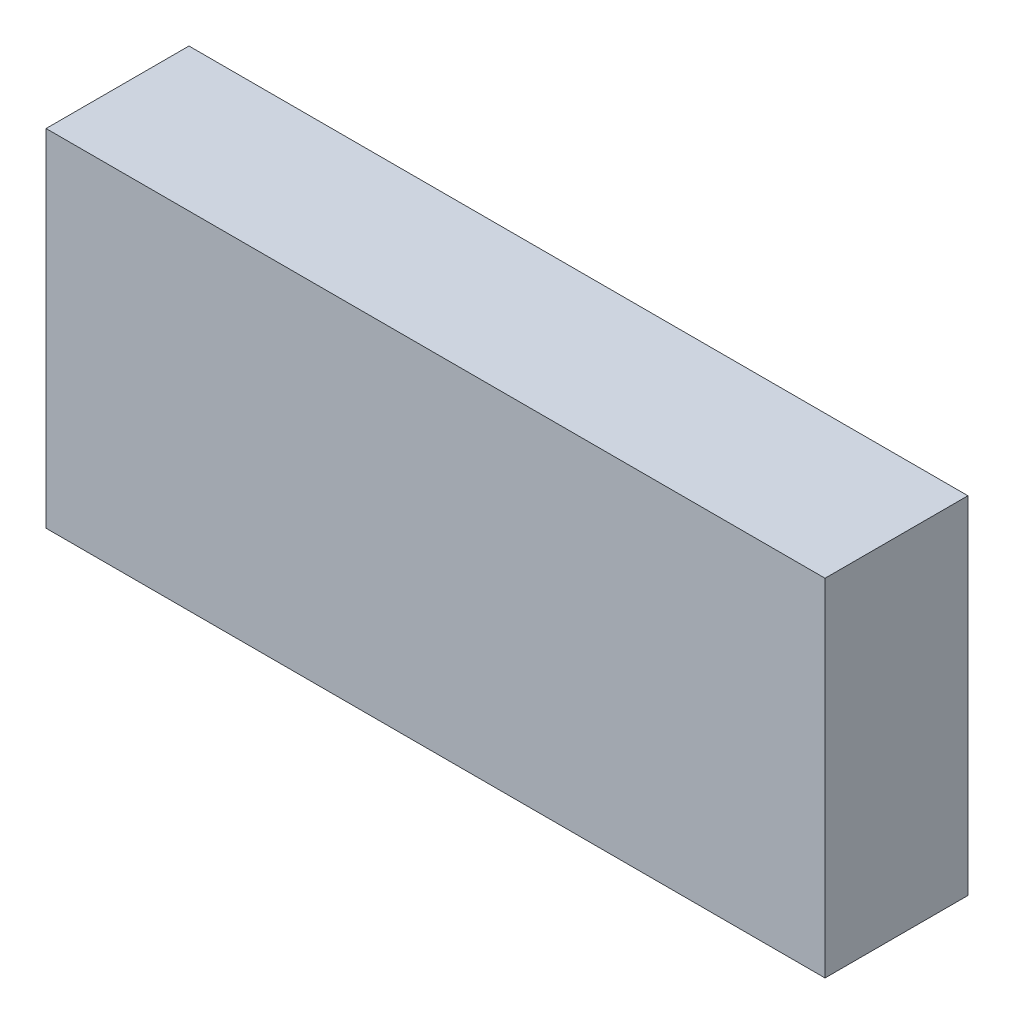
from build123d import *

# Parameters (mm, degrees)
SKETCH1_W               = 1.8
SKETCH1_H               = 0.8
COMPONENT_OUTLINE_DEPTH = 0.3302


with BuildPart() as part:
    # Sketch1 → Component_Outline (new body)
    with BuildSketch(Plane.XY):
        Rectangle(SKETCH1_W, SKETCH1_H)
    extrude(amount=COMPONENT_OUTLINE_DEPTH)


solid = part.part
